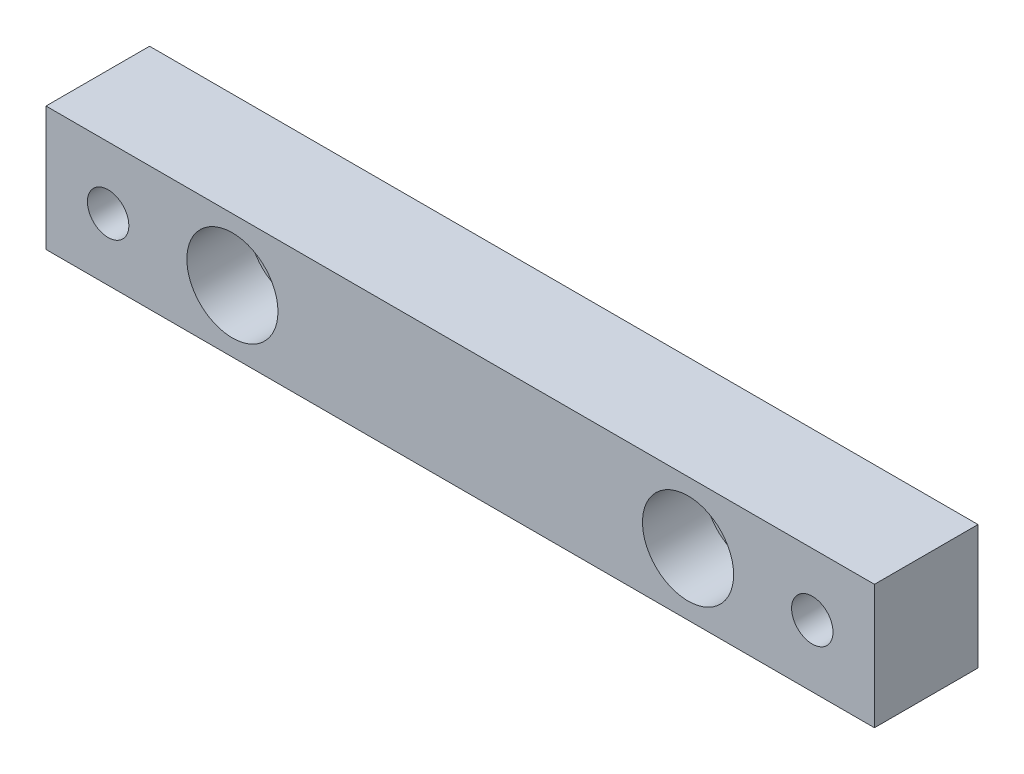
ISO-10303-21;
HEADER;
FILE_DESCRIPTION(('STEP AP214'),'2;1');
FILE_NAME('part.step','',(''),(''),'','','');
FILE_SCHEMA(('AUTOMOTIVE_DESIGN { 1 0 10303 214 1 1 1 1 }'));
ENDSEC;
DATA;
#1=APPLICATION_CONTEXT('core data for automotive mechanical design processes');
#2=APPLICATION_PROTOCOL_DEFINITION('international standard','automotive_design',2000,#1);
#3=PRODUCT_CONTEXT('',#1,'mechanical');
#4=PRODUCT('Part','Part','',(#3));
#5=PRODUCT_RELATED_PRODUCT_CATEGORY('part','',(#4));
#6=PRODUCT_DEFINITION_FORMATION('','',#4);
#7=PRODUCT_DEFINITION_CONTEXT('part definition',#1,'design');
#8=PRODUCT_DEFINITION('design','',#6,#7);
#9=PRODUCT_DEFINITION_SHAPE('','',#8);
#10=(LENGTH_UNIT() NAMED_UNIT(*) SI_UNIT(.MILLI.,.METRE.));
#11=(NAMED_UNIT(*) PLANE_ANGLE_UNIT() SI_UNIT($,.RADIAN.));
#12=(NAMED_UNIT(*) SI_UNIT($,.STERADIAN.) SOLID_ANGLE_UNIT());
#13=UNCERTAINTY_MEASURE_WITH_UNIT(LENGTH_MEASURE(1.E-05),#10,'distance_accuracy_value','');
#14=(GEOMETRIC_REPRESENTATION_CONTEXT(3) GLOBAL_UNCERTAINTY_ASSIGNED_CONTEXT((#13)) GLOBAL_UNIT_ASSIGNED_CONTEXT((#10,
#11,#12)) REPRESENTATION_CONTEXT('',''));
#15=CARTESIAN_POINT('',(0.,0.,0.));
#16=DIRECTION('',(0.,0.,1.));
#17=DIRECTION('',(1.,0.,0.));
#18=AXIS2_PLACEMENT_3D('',#15,#16,#17);
#19=CARTESIAN_POINT('',(-100.,-15.,25.));
#20=DIRECTION('',(0.,0.,1.));
#21=DIRECTION('',(1.,0.,0.));
#22=AXIS2_PLACEMENT_3D('',#19,#20,#21);
#23=PLANE('',#22);
#24=CARTESIAN_POINT('',(55.,0.,25.));
#25=DIRECTION('',(0.,0.,1.));
#26=DIRECTION('',(1.,0.,0.));
#27=AXIS2_PLACEMENT_3D('',#24,#25,#26);
#28=CIRCLE('',#27,11.);
#29=CARTESIAN_POINT('',(66.,0.,25.));
#30=VERTEX_POINT('',#29);
#31=EDGE_CURVE('E128',#30,#30,#28,.T.);
#32=ORIENTED_EDGE('',*,*,#31,.F.);
#33=EDGE_LOOP('',(#32));
#34=FACE_BOUND('',#33,.T.);
#35=CARTESIAN_POINT('',(-55.,0.,25.));
#36=DIRECTION('',(0.,0.,1.));
#37=DIRECTION('',(1.,0.,0.));
#38=AXIS2_PLACEMENT_3D('',#35,#36,#37);
#39=CIRCLE('',#38,11.);
#40=CARTESIAN_POINT('',(-44.,0.,25.));
#41=VERTEX_POINT('',#40);
#42=EDGE_CURVE('E116',#41,#41,#39,.T.);
#43=ORIENTED_EDGE('',*,*,#42,.F.);
#44=EDGE_LOOP('',(#43));
#45=FACE_BOUND('',#44,.T.);
#46=CARTESIAN_POINT('',(-85.,0.,25.));
#47=DIRECTION('',(0.,0.,1.));
#48=DIRECTION('',(1.,0.,0.));
#49=AXIS2_PLACEMENT_3D('',#46,#47,#48);
#50=CIRCLE('',#49,5.);
#51=CARTESIAN_POINT('',(-80.,0.,25.));
#52=VERTEX_POINT('',#51);
#53=EDGE_CURVE('E84',#52,#52,#50,.T.);
#54=ORIENTED_EDGE('',*,*,#53,.F.);
#55=EDGE_LOOP('',(#54));
#56=FACE_BOUND('',#55,.T.);
#57=DIRECTION('',(0.,-1.,0.));
#58=VECTOR('',#57,1.);
#59=CARTESIAN_POINT('',(-100.,15.,25.));
#60=LINE('',#59,#58);
#61=CARTESIAN_POINT('',(-100.,15.,25.));
#62=VERTEX_POINT('',#61);
#63=CARTESIAN_POINT('',(-100.,-15.,25.));
#64=VERTEX_POINT('',#63);
#65=EDGE_CURVE('E69',#62,#64,#60,.T.);
#66=ORIENTED_EDGE('',*,*,#65,.T.);
#67=DIRECTION('',(1.,0.,0.));
#68=VECTOR('',#67,1.);
#69=CARTESIAN_POINT('',(-100.,-15.,25.));
#70=LINE('',#69,#68);
#71=CARTESIAN_POINT('',(100.,-15.,25.));
#72=VERTEX_POINT('',#71);
#73=EDGE_CURVE('E64',#64,#72,#70,.T.);
#74=ORIENTED_EDGE('',*,*,#73,.T.);
#75=DIRECTION('',(0.,1.,0.));
#76=VECTOR('',#75,1.);
#77=CARTESIAN_POINT('',(100.,15.,25.));
#78=LINE('',#77,#76);
#79=CARTESIAN_POINT('',(100.,15.,25.));
#80=VERTEX_POINT('',#79);
#81=EDGE_CURVE('E67',#72,#80,#78,.T.);
#82=ORIENTED_EDGE('',*,*,#81,.T.);
#83=DIRECTION('',(-1.,0.,0.));
#84=VECTOR('',#83,1.);
#85=CARTESIAN_POINT('',(-100.,15.,25.));
#86=LINE('',#85,#84);
#87=EDGE_CURVE('E34',#80,#62,#86,.T.);
#88=ORIENTED_EDGE('',*,*,#87,.T.);
#89=EDGE_LOOP('',(#66,#74,#82,#88));
#90=FACE_BOUND('',#89,.T.);
#91=CARTESIAN_POINT('',(85.,0.,25.));
#92=DIRECTION('',(0.,0.,1.));
#93=DIRECTION('',(-1.,0.,0.));
#94=AXIS2_PLACEMENT_3D('',#91,#92,#93);
#95=CIRCLE('',#94,5.);
#96=CARTESIAN_POINT('',(80.,0.,25.));
#97=VERTEX_POINT('',#96);
#98=EDGE_CURVE('E99',#97,#97,#95,.T.);
#99=ORIENTED_EDGE('',*,*,#98,.F.);
#100=EDGE_LOOP('',(#99));
#101=FACE_BOUND('',#100,.T.);
#102=ADVANCED_FACE('F17',(#34,#45,#56,#90,#101),#23,.T.);
#103=CARTESIAN_POINT('',(-100.,-15.,0.));
#104=DIRECTION('',(0.,0.,1.));
#105=DIRECTION('',(1.,0.,0.));
#106=AXIS2_PLACEMENT_3D('',#103,#104,#105);
#107=PLANE('',#106);
#108=CARTESIAN_POINT('',(55.,0.,0.));
#109=DIRECTION('',(0.,0.,1.));
#110=DIRECTION('',(1.,0.,0.));
#111=AXIS2_PLACEMENT_3D('',#108,#109,#110);
#112=CIRCLE('',#111,6.5);
#113=CARTESIAN_POINT('',(61.5,0.,0.));
#114=VERTEX_POINT('',#113);
#115=EDGE_CURVE('E119',#114,#114,#112,.T.);
#116=ORIENTED_EDGE('',*,*,#115,.T.);
#117=EDGE_LOOP('',(#116));
#118=FACE_BOUND('',#117,.T.);
#119=CARTESIAN_POINT('',(-55.,0.,0.));
#120=DIRECTION('',(0.,0.,1.));
#121=DIRECTION('',(1.,0.,0.));
#122=AXIS2_PLACEMENT_3D('',#119,#120,#121);
#123=CIRCLE('',#122,6.5);
#124=CARTESIAN_POINT('',(-48.5,0.,0.));
#125=VERTEX_POINT('',#124);
#126=EDGE_CURVE('E105',#125,#125,#123,.T.);
#127=ORIENTED_EDGE('',*,*,#126,.T.);
#128=EDGE_LOOP('',(#127));
#129=FACE_BOUND('',#128,.T.);
#130=CARTESIAN_POINT('',(-85.,0.,0.));
#131=DIRECTION('',(0.,0.,1.));
#132=DIRECTION('',(1.,0.,0.));
#133=AXIS2_PLACEMENT_3D('',#130,#131,#132);
#134=CIRCLE('',#133,5.);
#135=CARTESIAN_POINT('',(-80.,0.,0.));
#136=VERTEX_POINT('',#135);
#137=EDGE_CURVE('E96',#136,#136,#134,.T.);
#138=ORIENTED_EDGE('',*,*,#137,.T.);
#139=EDGE_LOOP('',(#138));
#140=FACE_BOUND('',#139,.T.);
#141=DIRECTION('',(0.,-1.,0.));
#142=VECTOR('',#141,1.);
#143=CARTESIAN_POINT('',(-100.,15.,0.));
#144=LINE('',#143,#142);
#145=CARTESIAN_POINT('',(-100.,15.,0.));
#146=VERTEX_POINT('',#145);
#147=CARTESIAN_POINT('',(-100.,-15.,0.));
#148=VERTEX_POINT('',#147);
#149=EDGE_CURVE('E81',#146,#148,#144,.T.);
#150=ORIENTED_EDGE('',*,*,#149,.F.);
#151=DIRECTION('',(-1.,0.,0.));
#152=VECTOR('',#151,1.);
#153=CARTESIAN_POINT('',(-100.,15.,0.));
#154=LINE('',#153,#152);
#155=CARTESIAN_POINT('',(100.,15.,0.));
#156=VERTEX_POINT('',#155);
#157=EDGE_CURVE('E57',#156,#146,#154,.T.);
#158=ORIENTED_EDGE('',*,*,#157,.F.);
#159=DIRECTION('',(0.,1.,0.));
#160=VECTOR('',#159,1.);
#161=CARTESIAN_POINT('',(100.,15.,0.));
#162=LINE('',#161,#160);
#163=CARTESIAN_POINT('',(100.,-15.,0.));
#164=VERTEX_POINT('',#163);
#165=EDGE_CURVE('E51',#164,#156,#162,.T.);
#166=ORIENTED_EDGE('',*,*,#165,.F.);
#167=DIRECTION('',(1.,0.,0.));
#168=VECTOR('',#167,1.);
#169=CARTESIAN_POINT('',(-100.,-15.,0.));
#170=LINE('',#169,#168);
#171=EDGE_CURVE('E73',#148,#164,#170,.T.);
#172=ORIENTED_EDGE('',*,*,#171,.F.);
#173=EDGE_LOOP('',(#150,#158,#166,#172));
#174=FACE_BOUND('',#173,.T.);
#175=CARTESIAN_POINT('',(85.,0.,0.));
#176=DIRECTION('',(0.,0.,1.));
#177=DIRECTION('',(-1.,0.,0.));
#178=AXIS2_PLACEMENT_3D('',#175,#176,#177);
#179=CIRCLE('',#178,5.);
#180=CARTESIAN_POINT('',(80.,0.,0.));
#181=VERTEX_POINT('',#180);
#182=EDGE_CURVE('E102',#181,#181,#179,.T.);
#183=ORIENTED_EDGE('',*,*,#182,.T.);
#184=EDGE_LOOP('',(#183));
#185=FACE_BOUND('',#184,.T.);
#186=ADVANCED_FACE('F92',(#118,#129,#140,#174,#185),#107,.F.);
#187=CARTESIAN_POINT('',(-100.,15.,25.));
#188=DIRECTION('',(1.,0.,0.));
#189=DIRECTION('',(0.,0.,-1.));
#190=AXIS2_PLACEMENT_3D('',#187,#188,#189);
#191=PLANE('',#190);
#192=ORIENTED_EDGE('',*,*,#149,.T.);
#193=DIRECTION('',(0.,0.,-1.));
#194=VECTOR('',#193,1.);
#195=CARTESIAN_POINT('',(-100.,-15.,25.));
#196=LINE('',#195,#194);
#197=EDGE_CURVE('E11',#64,#148,#196,.T.);
#198=ORIENTED_EDGE('',*,*,#197,.F.);
#199=ORIENTED_EDGE('',*,*,#65,.F.);
#200=DIRECTION('',(0.,0.,-1.));
#201=VECTOR('',#200,1.);
#202=CARTESIAN_POINT('',(-100.,15.,25.));
#203=LINE('',#202,#201);
#204=EDGE_CURVE('E77',#62,#146,#203,.T.);
#205=ORIENTED_EDGE('',*,*,#204,.T.);
#206=EDGE_LOOP('',(#192,#198,#199,#205));
#207=FACE_BOUND('',#206,.T.);
#208=ADVANCED_FACE('F19',(#207),#191,.F.);
#209=CARTESIAN_POINT('',(-100.,-15.,25.));
#210=DIRECTION('',(0.,1.,0.));
#211=DIRECTION('',(0.,0.,1.));
#212=AXIS2_PLACEMENT_3D('',#209,#210,#211);
#213=PLANE('',#212);
#214=ORIENTED_EDGE('',*,*,#171,.T.);
#215=DIRECTION('',(0.,0.,-1.));
#216=VECTOR('',#215,1.);
#217=CARTESIAN_POINT('',(100.,-15.,25.));
#218=LINE('',#217,#216);
#219=EDGE_CURVE('E26',#72,#164,#218,.T.);
#220=ORIENTED_EDGE('',*,*,#219,.F.);
#221=ORIENTED_EDGE('',*,*,#73,.F.);
#222=ORIENTED_EDGE('',*,*,#197,.T.);
#223=EDGE_LOOP('',(#214,#220,#221,#222));
#224=FACE_BOUND('',#223,.T.);
#225=ADVANCED_FACE('F72',(#224),#213,.F.);
#226=CARTESIAN_POINT('',(100.,15.,25.));
#227=DIRECTION('',(-1.,0.,0.));
#228=DIRECTION('',(0.,0.,1.));
#229=AXIS2_PLACEMENT_3D('',#226,#227,#228);
#230=PLANE('',#229);
#231=ORIENTED_EDGE('',*,*,#165,.T.);
#232=DIRECTION('',(0.,0.,-1.));
#233=VECTOR('',#232,1.);
#234=CARTESIAN_POINT('',(100.,15.,25.));
#235=LINE('',#234,#233);
#236=EDGE_CURVE('E74',#80,#156,#235,.T.);
#237=ORIENTED_EDGE('',*,*,#236,.F.);
#238=ORIENTED_EDGE('',*,*,#81,.F.);
#239=ORIENTED_EDGE('',*,*,#219,.T.);
#240=EDGE_LOOP('',(#231,#237,#238,#239));
#241=FACE_BOUND('',#240,.T.);
#242=ADVANCED_FACE('F75',(#241),#230,.F.);
#243=CARTESIAN_POINT('',(-100.,15.,25.));
#244=DIRECTION('',(0.,-1.,0.));
#245=DIRECTION('',(0.,0.,-1.));
#246=AXIS2_PLACEMENT_3D('',#243,#244,#245);
#247=PLANE('',#246);
#248=ORIENTED_EDGE('',*,*,#157,.T.);
#249=ORIENTED_EDGE('',*,*,#204,.F.);
#250=ORIENTED_EDGE('',*,*,#87,.F.);
#251=ORIENTED_EDGE('',*,*,#236,.T.);
#252=EDGE_LOOP('',(#248,#249,#250,#251));
#253=FACE_BOUND('',#252,.T.);
#254=ADVANCED_FACE('F89',(#253),#247,.F.);
#255=CARTESIAN_POINT('',(-85.,0.,25.));
#256=DIRECTION('',(0.,0.,-1.));
#257=DIRECTION('',(-1.,0.,0.));
#258=AXIS2_PLACEMENT_3D('',#255,#256,#257);
#259=CYLINDRICAL_SURFACE('',#258,5.);
#260=ORIENTED_EDGE('',*,*,#53,.T.);
#261=EDGE_LOOP('',(#260));
#262=FACE_BOUND('',#261,.T.);
#263=ORIENTED_EDGE('',*,*,#137,.F.);
#264=EDGE_LOOP('',(#263));
#265=FACE_BOUND('',#264,.T.);
#266=ADVANCED_FACE('F141',(#262,#265),#259,.F.);
#267=CARTESIAN_POINT('',(85.,0.,25.));
#268=DIRECTION('',(0.,0.,-1.));
#269=DIRECTION('',(-1.,0.,0.));
#270=AXIS2_PLACEMENT_3D('',#267,#268,#269);
#271=CYLINDRICAL_SURFACE('',#270,5.);
#272=ORIENTED_EDGE('',*,*,#98,.T.);
#273=EDGE_LOOP('',(#272));
#274=FACE_BOUND('',#273,.T.);
#275=ORIENTED_EDGE('',*,*,#182,.F.);
#276=EDGE_LOOP('',(#275));
#277=FACE_BOUND('',#276,.T.);
#278=ADVANCED_FACE('F144',(#274,#277),#271,.F.);
#279=CARTESIAN_POINT('',(-55.,0.,25.));
#280=DIRECTION('',(0.,0.,1.));
#281=DIRECTION('',(1.,0.,0.));
#282=AXIS2_PLACEMENT_3D('',#279,#280,#281);
#283=CYLINDRICAL_SURFACE('',#282,6.5);
#284=ORIENTED_EDGE('',*,*,#126,.F.);
#285=EDGE_LOOP('',(#284));
#286=FACE_BOUND('',#285,.T.);
#287=CARTESIAN_POINT('',(-55.,0.,10.));
#288=DIRECTION('',(0.,0.,1.));
#289=DIRECTION('',(1.,0.,0.));
#290=AXIS2_PLACEMENT_3D('',#287,#288,#289);
#291=CIRCLE('',#290,6.5);
#292=CARTESIAN_POINT('',(-48.5,0.,10.));
#293=VERTEX_POINT('',#292);
#294=EDGE_CURVE('E110',#293,#293,#291,.T.);
#295=ORIENTED_EDGE('',*,*,#294,.T.);
#296=EDGE_LOOP('',(#295));
#297=FACE_BOUND('',#296,.T.);
#298=ADVANCED_FACE('F193',(#286,#297),#283,.F.);
#299=CARTESIAN_POINT('',(-48.5,0.,10.));
#300=DIRECTION('',(0.,0.,-1.));
#301=DIRECTION('',(-1.,0.,0.));
#302=AXIS2_PLACEMENT_3D('',#299,#300,#301);
#303=PLANE('',#302);
#304=ORIENTED_EDGE('',*,*,#294,.F.);
#305=EDGE_LOOP('',(#304));
#306=FACE_BOUND('',#305,.T.);
#307=CARTESIAN_POINT('',(-55.,0.,10.));
#308=DIRECTION('',(0.,0.,1.));
#309=DIRECTION('',(1.,0.,0.));
#310=AXIS2_PLACEMENT_3D('',#307,#308,#309);
#311=CIRCLE('',#310,11.);
#312=CARTESIAN_POINT('',(-44.,0.,10.));
#313=VERTEX_POINT('',#312);
#314=EDGE_CURVE('E113',#313,#313,#311,.T.);
#315=ORIENTED_EDGE('',*,*,#314,.T.);
#316=EDGE_LOOP('',(#315));
#317=FACE_BOUND('',#316,.T.);
#318=ADVANCED_FACE('F202',(#306,#317),#303,.F.);
#319=CARTESIAN_POINT('',(-55.,0.,25.));
#320=DIRECTION('',(0.,0.,1.));
#321=DIRECTION('',(1.,0.,0.));
#322=AXIS2_PLACEMENT_3D('',#319,#320,#321);
#323=CYLINDRICAL_SURFACE('',#322,11.);
#324=ORIENTED_EDGE('',*,*,#314,.F.);
#325=EDGE_LOOP('',(#324));
#326=FACE_BOUND('',#325,.T.);
#327=ORIENTED_EDGE('',*,*,#42,.T.);
#328=EDGE_LOOP('',(#327));
#329=FACE_BOUND('',#328,.T.);
#330=ADVANCED_FACE('F211',(#326,#329),#323,.F.);
#331=CARTESIAN_POINT('',(55.,0.,25.));
#332=DIRECTION('',(0.,0.,1.));
#333=DIRECTION('',(1.,0.,0.));
#334=AXIS2_PLACEMENT_3D('',#331,#332,#333);
#335=CYLINDRICAL_SURFACE('',#334,6.5);
#336=ORIENTED_EDGE('',*,*,#115,.F.);
#337=EDGE_LOOP('',(#336));
#338=FACE_BOUND('',#337,.T.);
#339=CARTESIAN_POINT('',(55.,0.,10.));
#340=DIRECTION('',(0.,0.,1.));
#341=DIRECTION('',(1.,0.,0.));
#342=AXIS2_PLACEMENT_3D('',#339,#340,#341);
#343=CIRCLE('',#342,6.5);
#344=CARTESIAN_POINT('',(61.5,0.,10.));
#345=VERTEX_POINT('',#344);
#346=EDGE_CURVE('E122',#345,#345,#343,.T.);
#347=ORIENTED_EDGE('',*,*,#346,.T.);
#348=EDGE_LOOP('',(#347));
#349=FACE_BOUND('',#348,.T.);
#350=ADVANCED_FACE('F220',(#338,#349),#335,.F.);
#351=CARTESIAN_POINT('',(61.5,0.,10.));
#352=DIRECTION('',(0.,0.,-1.));
#353=DIRECTION('',(-1.,0.,0.));
#354=AXIS2_PLACEMENT_3D('',#351,#352,#353);
#355=PLANE('',#354);
#356=ORIENTED_EDGE('',*,*,#346,.F.);
#357=EDGE_LOOP('',(#356));
#358=FACE_BOUND('',#357,.T.);
#359=CARTESIAN_POINT('',(55.,0.,10.));
#360=DIRECTION('',(0.,0.,1.));
#361=DIRECTION('',(1.,0.,0.));
#362=AXIS2_PLACEMENT_3D('',#359,#360,#361);
#363=CIRCLE('',#362,11.);
#364=CARTESIAN_POINT('',(66.,0.,10.));
#365=VERTEX_POINT('',#364);
#366=EDGE_CURVE('E125',#365,#365,#363,.T.);
#367=ORIENTED_EDGE('',*,*,#366,.T.);
#368=EDGE_LOOP('',(#367));
#369=FACE_BOUND('',#368,.T.);
#370=ADVANCED_FACE('F229',(#358,#369),#355,.F.);
#371=CARTESIAN_POINT('',(55.,0.,25.));
#372=DIRECTION('',(0.,0.,1.));
#373=DIRECTION('',(1.,0.,0.));
#374=AXIS2_PLACEMENT_3D('',#371,#372,#373);
#375=CYLINDRICAL_SURFACE('',#374,11.);
#376=ORIENTED_EDGE('',*,*,#366,.F.);
#377=EDGE_LOOP('',(#376));
#378=FACE_BOUND('',#377,.T.);
#379=ORIENTED_EDGE('',*,*,#31,.T.);
#380=EDGE_LOOP('',(#379));
#381=FACE_BOUND('',#380,.T.);
#382=ADVANCED_FACE('F132',(#378,#381),#375,.F.);
#383=CLOSED_SHELL('',(#102,#186,#208,#225,#242,#254,#266,#278,#298,#318,#330,#350,#370,#382));
#384=MANIFOLD_SOLID_BREP('B1',#383);
#385=ADVANCED_BREP_SHAPE_REPRESENTATION('',(#18,#384),#14);
#386=SHAPE_DEFINITION_REPRESENTATION(#9,#385);
ENDSEC;
END-ISO-10303-21;
